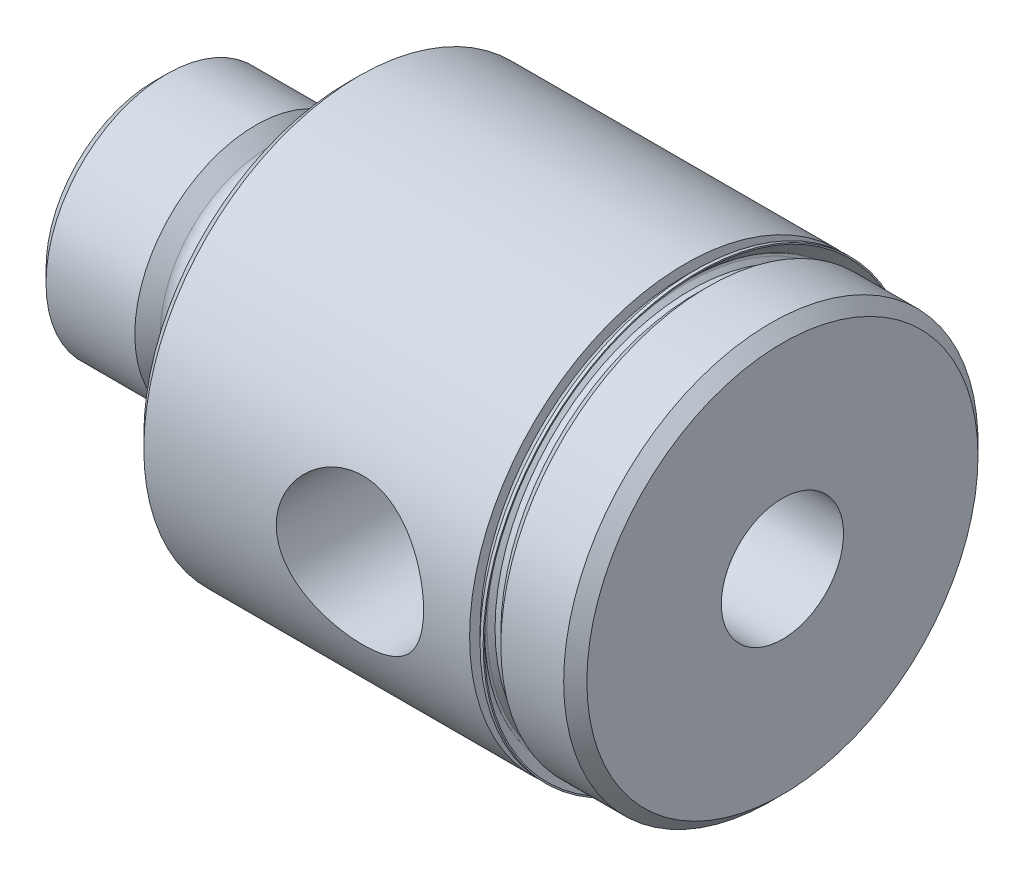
ISO-10303-21;
HEADER;
FILE_DESCRIPTION(('STEP AP214'),'2;1');
FILE_NAME('part.step','',(''),(''),'','','');
FILE_SCHEMA(('AUTOMOTIVE_DESIGN { 1 0 10303 214 1 1 1 1 }'));
ENDSEC;
DATA;
#1=APPLICATION_CONTEXT('core data for automotive mechanical design processes');
#2=APPLICATION_PROTOCOL_DEFINITION('international standard','automotive_design',2000,#1);
#3=PRODUCT_CONTEXT('',#1,'mechanical');
#4=PRODUCT('Part','Part','',(#3));
#5=PRODUCT_RELATED_PRODUCT_CATEGORY('part','',(#4));
#6=PRODUCT_DEFINITION_FORMATION('','',#4);
#7=PRODUCT_DEFINITION_CONTEXT('part definition',#1,'design');
#8=PRODUCT_DEFINITION('design','',#6,#7);
#9=PRODUCT_DEFINITION_SHAPE('','',#8);
#10=(LENGTH_UNIT() NAMED_UNIT(*) SI_UNIT(.MILLI.,.METRE.));
#11=(NAMED_UNIT(*) PLANE_ANGLE_UNIT() SI_UNIT($,.RADIAN.));
#12=(NAMED_UNIT(*) SI_UNIT($,.STERADIAN.) SOLID_ANGLE_UNIT());
#13=UNCERTAINTY_MEASURE_WITH_UNIT(LENGTH_MEASURE(1.E-05),#10,'distance_accuracy_value','');
#14=(GEOMETRIC_REPRESENTATION_CONTEXT(3) GLOBAL_UNCERTAINTY_ASSIGNED_CONTEXT((#13)) GLOBAL_UNIT_ASSIGNED_CONTEXT((#10,
#11,#12)) REPRESENTATION_CONTEXT('',''));
#15=CARTESIAN_POINT('',(0.,0.,0.));
#16=DIRECTION('',(0.,0.,1.));
#17=DIRECTION('',(1.,0.,0.));
#18=AXIS2_PLACEMENT_3D('',#15,#16,#17);
#19=CARTESIAN_POINT('',(41.275,0.,0.));
#20=DIRECTION('',(-1.,0.,0.));
#21=DIRECTION('',(0.,0.,1.));
#22=AXIS2_PLACEMENT_3D('',#19,#20,#21);
#23=CYLINDRICAL_SURFACE('',#22,12.84605);
#24=CARTESIAN_POINT('',(35.2425,0.,0.));
#25=DIRECTION('',(-1.,0.,0.));
#26=DIRECTION('',(0.,0.,1.));
#27=AXIS2_PLACEMENT_3D('',#24,#25,#26);
#28=CIRCLE('',#27,12.84605);
#29=CARTESIAN_POINT('',(35.2425,0.,12.84605));
#30=VERTEX_POINT('',#29);
#31=EDGE_CURVE('E184',#30,#30,#28,.T.);
#32=ORIENTED_EDGE('',*,*,#31,.F.);
#33=EDGE_LOOP('',(#32));
#34=FACE_BOUND('',#33,.T.);
#35=CARTESIAN_POINT('',(35.6235,0.,0.));
#36=DIRECTION('',(1.,0.,0.));
#37=DIRECTION('',(0.,0.,-1.));
#38=AXIS2_PLACEMENT_3D('',#35,#36,#37);
#39=CIRCLE('',#38,12.84605);
#40=CARTESIAN_POINT('',(35.6235,0.,-12.84605));
#41=VERTEX_POINT('',#40);
#42=EDGE_CURVE('E183',#41,#41,#39,.T.);
#43=ORIENTED_EDGE('',*,*,#42,.F.);
#44=EDGE_LOOP('',(#43));
#45=FACE_BOUND('',#44,.T.);
#46=ADVANCED_FACE('F17',(#34,#45),#23,.T.);
#47=CARTESIAN_POINT('',(6.67261207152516,0.,0.));
#48=DIRECTION('',(-1.,0.,0.));
#49=DIRECTION('',(0.,-1.,0.));
#50=AXIS2_PLACEMENT_3D('',#47,#48,#49);
#51=CONICAL_SURFACE('',#50,7.9375,0.784622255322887);
#52=CARTESIAN_POINT('',(6.67261207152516,0.,0.));
#53=DIRECTION('',(-1.,0.,0.));
#54=DIRECTION('',(0.,0.,1.));
#55=AXIS2_PLACEMENT_3D('',#52,#53,#54);
#56=CIRCLE('',#55,7.9375);
#57=CARTESIAN_POINT('',(6.67261207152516,0.,7.9375));
#58=VERTEX_POINT('',#57);
#59=EDGE_CURVE('E619',#58,#58,#56,.T.);
#60=ORIENTED_EDGE('',*,*,#59,.F.);
#61=EDGE_LOOP('',(#60));
#62=FACE_BOUND('',#61,.T.);
#63=CARTESIAN_POINT('',(7.51257001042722,0.,0.));
#64=DIRECTION('',(1.,0.,0.));
#65=DIRECTION('',(0.,0.,-1.));
#66=AXIS2_PLACEMENT_3D('',#63,#64,#65);
#67=CIRCLE('',#66,7.09884451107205);
#68=CARTESIAN_POINT('',(7.51257001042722,0.,-7.09884451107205));
#69=VERTEX_POINT('',#68);
#70=EDGE_CURVE('E180',#69,#69,#67,.F.);
#71=ORIENTED_EDGE('',*,*,#70,.T.);
#72=EDGE_LOOP('',(#71));
#73=FACE_BOUND('',#72,.T.);
#74=ADVANCED_FACE('F313',(#62,#73),#51,.T.);
#75=CARTESIAN_POINT('',(34.9839871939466,0.,0.));
#76=DIRECTION('',(-1.,0.,0.));
#77=DIRECTION('',(0.,0.,1.));
#78=AXIS2_PLACEMENT_3D('',#75,#76,#77);
#79=CONICAL_SURFACE('',#78,13.1045628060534,0.785398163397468);
#80=ORIENTED_EDGE('',*,*,#31,.T.);
#81=EDGE_LOOP('',(#80));
#82=FACE_BOUND('',#81,.T.);
#83=CARTESIAN_POINT('',(34.9839871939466,0.,0.));
#84=DIRECTION('',(1.,0.,0.));
#85=DIRECTION('',(0.,0.,-1.));
#86=AXIS2_PLACEMENT_3D('',#83,#84,#85);
#87=CIRCLE('',#86,13.1045628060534);
#88=CARTESIAN_POINT('',(34.9839871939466,0.,-13.1045628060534));
#89=VERTEX_POINT('',#88);
#90=EDGE_CURVE('E147',#89,#89,#87,.T.);
#91=ORIENTED_EDGE('',*,*,#90,.T.);
#92=EDGE_LOOP('',(#91));
#93=FACE_BOUND('',#92,.T.);
#94=ADVANCED_FACE('F173',(#82,#93),#79,.T.);
#95=CARTESIAN_POINT('',(8.1407,0.,0.));
#96=DIRECTION('',(1.,0.,0.));
#97=DIRECTION('',(0.,0.,-1.));
#98=AXIS2_PLACEMENT_3D('',#95,#96,#97);
#99=TOROIDAL_SURFACE('',#98,7.72795,0.88899999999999);
#100=ORIENTED_EDGE('',*,*,#70,.F.);
#101=EDGE_LOOP('',(#100));
#102=FACE_BOUND('',#101,.T.);
#103=CARTESIAN_POINT('',(8.1407,0.,0.));
#104=DIRECTION('',(-1.,0.,0.));
#105=DIRECTION('',(0.,0.,1.));
#106=AXIS2_PLACEMENT_3D('',#103,#104,#105);
#107=CIRCLE('',#106,6.83895);
#108=CARTESIAN_POINT('',(8.1407,0.,6.83895));
#109=VERTEX_POINT('',#108);
#110=EDGE_CURVE('E142',#109,#109,#107,.F.);
#111=ORIENTED_EDGE('',*,*,#110,.F.);
#112=EDGE_LOOP('',(#111));
#113=FACE_BOUND('',#112,.T.);
#114=ADVANCED_FACE('F168',(#102,#113),#99,.F.);
#115=CARTESIAN_POINT('',(36.3855,0.,0.));
#116=DIRECTION('',(1.,0.,0.));
#117=DIRECTION('',(0.,0.,-1.));
#118=AXIS2_PLACEMENT_3D('',#115,#116,#117);
#119=CONICAL_SURFACE('',#118,13.60805,0.78539816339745);
#120=ORIENTED_EDGE('',*,*,#42,.T.);
#121=EDGE_LOOP('',(#120));
#122=FACE_BOUND('',#121,.T.);
#123=CARTESIAN_POINT('',(36.3855,0.,0.));
#124=DIRECTION('',(-1.,0.,0.));
#125=DIRECTION('',(0.,0.,1.));
#126=AXIS2_PLACEMENT_3D('',#123,#124,#125);
#127=CIRCLE('',#126,13.60805);
#128=CARTESIAN_POINT('',(36.3855,0.,13.60805));
#129=VERTEX_POINT('',#128);
#130=EDGE_CURVE('E137',#129,#129,#127,.F.);
#131=ORIENTED_EDGE('',*,*,#130,.F.);
#132=EDGE_LOOP('',(#131));
#133=FACE_BOUND('',#132,.T.);
#134=ADVANCED_FACE('F164',(#122,#133),#119,.T.);
#135=CARTESIAN_POINT('',(12.7,0.,0.));
#136=DIRECTION('',(-1.,0.,0.));
#137=DIRECTION('',(0.,0.,1.));
#138=AXIS2_PLACEMENT_3D('',#135,#136,#137);
#139=CYLINDRICAL_SURFACE('',#138,7.9375);
#140=CARTESIAN_POINT('',(0.83947,0.,0.));
#141=DIRECTION('',(1.,0.,0.));
#142=DIRECTION('',(0.,0.,-1.));
#143=AXIS2_PLACEMENT_3D('',#140,#141,#142);
#144=CIRCLE('',#143,7.9375);
#145=CARTESIAN_POINT('',(0.83947,0.,-7.9375));
#146=VERTEX_POINT('',#145);
#147=EDGE_CURVE('E132',#146,#146,#144,.F.);
#148=ORIENTED_EDGE('',*,*,#147,.F.);
#149=EDGE_LOOP('',(#148));
#150=FACE_BOUND('',#149,.T.);
#151=ORIENTED_EDGE('',*,*,#59,.T.);
#152=EDGE_LOOP('',(#151));
#153=FACE_BOUND('',#152,.T.);
#154=ADVANCED_FACE('F159',(#150,#153),#139,.T.);
#155=CARTESIAN_POINT('',(35.0737897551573,0.,0.));
#156=DIRECTION('',(1.,0.,0.));
#157=DIRECTION('',(0.,0.,-1.));
#158=AXIS2_PLACEMENT_3D('',#155,#156,#157);
#159=TOROIDAL_SURFACE('',#158,13.1943653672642,0.127000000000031);
#160=CARTESIAN_POINT('',(34.9839871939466,0.,0.));
#161=DIRECTION('',(1.,0.,0.));
#162=DIRECTION('',(0.,0.,-1.));
#163=AXIS2_PLACEMENT_3D('',#160,#161,#162);
#164=CIRCLE('',#163,13.2841679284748);
#165=CARTESIAN_POINT('',(34.9839871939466,0.,-13.2841679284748));
#166=VERTEX_POINT('',#165);
#167=EDGE_CURVE('E118',#166,#166,#164,.T.);
#168=ORIENTED_EDGE('',*,*,#167,.T.);
#169=EDGE_LOOP('',(#168));
#170=FACE_BOUND('',#169,.T.);
#171=ORIENTED_EDGE('',*,*,#90,.F.);
#172=EDGE_LOOP('',(#171));
#173=FACE_BOUND('',#172,.T.);
#174=ADVANCED_FACE('F154',(#170,#173),#159,.F.);
#175=CARTESIAN_POINT('',(12.7,0.,0.));
#176=DIRECTION('',(-1.,0.,0.));
#177=DIRECTION('',(0.,0.,1.));
#178=AXIS2_PLACEMENT_3D('',#175,#176,#177);
#179=CYLINDRICAL_SURFACE('',#178,6.83895);
#180=ORIENTED_EDGE('',*,*,#110,.T.);
#181=EDGE_LOOP('',(#180));
#182=FACE_BOUND('',#181,.T.);
#183=CARTESIAN_POINT('',(9.4234,0.,0.));
#184=DIRECTION('',(1.,0.,0.));
#185=DIRECTION('',(0.,0.,-1.));
#186=AXIS2_PLACEMENT_3D('',#183,#184,#185);
#187=CIRCLE('',#186,6.83894999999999);
#188=CARTESIAN_POINT('',(9.4234,0.,-6.83894999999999));
#189=VERTEX_POINT('',#188);
#190=EDGE_CURVE('E115',#189,#189,#187,.F.);
#191=ORIENTED_EDGE('',*,*,#190,.T.);
#192=EDGE_LOOP('',(#191));
#193=FACE_BOUND('',#192,.T.);
#194=ADVANCED_FACE('F158',(#182,#193),#179,.T.);
#195=CARTESIAN_POINT('',(41.275,0.,0.));
#196=DIRECTION('',(-1.,0.,0.));
#197=DIRECTION('',(0.,0.,1.));
#198=AXIS2_PLACEMENT_3D('',#195,#196,#197);
#199=CYLINDRICAL_SURFACE('',#198,13.60805);
#200=ORIENTED_EDGE('',*,*,#130,.T.);
#201=EDGE_LOOP('',(#200));
#202=FACE_BOUND('',#201,.T.);
#203=CARTESIAN_POINT('',(40.513,0.,0.));
#204=DIRECTION('',(-1.,0.,0.));
#205=DIRECTION('',(0.,0.,1.));
#206=AXIS2_PLACEMENT_3D('',#203,#204,#205);
#207=CIRCLE('',#206,13.60805);
#208=CARTESIAN_POINT('',(40.513,0.,13.60805));
#209=VERTEX_POINT('',#208);
#210=EDGE_CURVE('E77',#209,#209,#207,.F.);
#211=ORIENTED_EDGE('',*,*,#210,.F.);
#212=EDGE_LOOP('',(#211));
#213=FACE_BOUND('',#212,.T.);
#214=ADVANCED_FACE('F272',(#202,#213),#199,.T.);
#215=CARTESIAN_POINT('',(0.83947,0.,0.));
#216=DIRECTION('',(1.,0.,0.));
#217=DIRECTION('',(0.,1.,0.));
#218=AXIS2_PLACEMENT_3D('',#215,#216,#217);
#219=CONICAL_SURFACE('',#218,7.9375,0.785398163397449);
#220=CARTESIAN_POINT('',(0.,0.,0.));
#221=DIRECTION('',(1.,0.,0.));
#222=DIRECTION('',(0.,1.,0.));
#223=AXIS2_PLACEMENT_3D('',#220,#221,#222);
#224=CIRCLE('',#223,7.09803);
#225=CARTESIAN_POINT('',(0.,7.09803,0.));
#226=VERTEX_POINT('',#225);
#227=EDGE_CURVE('E20',#226,#226,#224,.T.);
#228=ORIENTED_EDGE('',*,*,#227,.T.);
#229=EDGE_LOOP('',(#228));
#230=FACE_BOUND('',#229,.T.);
#231=ORIENTED_EDGE('',*,*,#147,.T.);
#232=EDGE_LOOP('',(#231));
#233=FACE_BOUND('',#232,.T.);
#234=ADVANCED_FACE('F274',(#230,#233),#219,.T.);
#235=CARTESIAN_POINT('',(35.7507510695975,0.,0.));
#236=DIRECTION('',(1.,0.,0.));
#237=DIRECTION('',(0.,0.,-1.));
#238=AXIS2_PLACEMENT_3D('',#235,#236,#237);
#239=CONICAL_SURFACE('',#238,14.0509318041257,0.785398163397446);
#240=ORIENTED_EDGE('',*,*,#167,.F.);
#241=EDGE_LOOP('',(#240));
#242=FACE_BOUND('',#241,.T.);
#243=CARTESIAN_POINT('',(35.7507510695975,0.,0.));
#244=DIRECTION('',(1.,0.,0.));
#245=DIRECTION('',(0.,0.,-1.));
#246=AXIS2_PLACEMENT_3D('',#243,#244,#245);
#247=CIRCLE('',#246,14.0509318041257);
#248=CARTESIAN_POINT('',(35.7507510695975,0.,-14.0509318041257));
#249=VERTEX_POINT('',#248);
#250=EDGE_CURVE('E262',#249,#249,#247,.F.);
#251=ORIENTED_EDGE('',*,*,#250,.F.);
#252=EDGE_LOOP('',(#251));
#253=FACE_BOUND('',#252,.T.);
#254=ADVANCED_FACE('F108',(#242,#253),#239,.F.);
#255=CARTESIAN_POINT('',(9.4234,0.,0.));
#256=DIRECTION('',(1.,0.,0.));
#257=DIRECTION('',(0.,0.,-1.));
#258=AXIS2_PLACEMENT_3D('',#255,#256,#257);
#259=TOROIDAL_SURFACE('',#258,7.72795,0.889000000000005);
#260=ORIENTED_EDGE('',*,*,#190,.F.);
#261=EDGE_LOOP('',(#260));
#262=FACE_BOUND('',#261,.T.);
#263=CARTESIAN_POINT('',(10.3124,0.,0.));
#264=DIRECTION('',(-1.,0.,0.));
#265=DIRECTION('',(0.,0.,-1.));
#266=AXIS2_PLACEMENT_3D('',#263,#264,#265);
#267=CIRCLE('',#266,7.72795);
#268=CARTESIAN_POINT('',(10.3124,0.,-7.72795));
#269=VERTEX_POINT('',#268);
#270=EDGE_CURVE('E72',#269,#269,#267,.T.);
#271=ORIENTED_EDGE('',*,*,#270,.T.);
#272=EDGE_LOOP('',(#271));
#273=FACE_BOUND('',#272,.T.);
#274=ADVANCED_FACE('F102',(#262,#273),#259,.F.);
#275=CARTESIAN_POINT('',(40.513,0.,0.));
#276=DIRECTION('',(-1.,0.,0.));
#277=DIRECTION('',(0.,0.,1.));
#278=AXIS2_PLACEMENT_3D('',#275,#276,#277);
#279=CONICAL_SURFACE('',#278,13.60805,0.78539816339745);
#280=ORIENTED_EDGE('',*,*,#210,.T.);
#281=EDGE_LOOP('',(#280));
#282=FACE_BOUND('',#281,.T.);
#283=CARTESIAN_POINT('',(41.275,0.,0.));
#284=DIRECTION('',(-1.,0.,0.));
#285=DIRECTION('',(0.,0.,1.));
#286=AXIS2_PLACEMENT_3D('',#283,#284,#285);
#287=CIRCLE('',#286,12.84605);
#288=CARTESIAN_POINT('',(41.275,0.,12.84605));
#289=VERTEX_POINT('',#288);
#290=EDGE_CURVE('E260',#289,#289,#287,.T.);
#291=ORIENTED_EDGE('',*,*,#290,.T.);
#292=EDGE_LOOP('',(#291));
#293=FACE_BOUND('',#292,.T.);
#294=ADVANCED_FACE('F98',(#282,#293),#279,.T.);
#295=CARTESIAN_POINT('',(0.,0.,0.));
#296=DIRECTION('',(1.,0.,0.));
#297=DIRECTION('',(0.,0.,-1.));
#298=AXIS2_PLACEMENT_3D('',#295,#296,#297);
#299=PLANE('',#298);
#300=CARTESIAN_POINT('',(0.,0.,0.));
#301=DIRECTION('',(-1.,0.,0.));
#302=DIRECTION('',(0.,0.,1.));
#303=AXIS2_PLACEMENT_3D('',#300,#301,#302);
#304=CIRCLE('',#303,4.77519999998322);
#305=CARTESIAN_POINT('',(0.,0.,4.77519999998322));
#306=VERTEX_POINT('',#305);
#307=EDGE_CURVE('E257',#306,#306,#304,.F.);
#308=ORIENTED_EDGE('',*,*,#307,.T.);
#309=EDGE_LOOP('',(#308));
#310=FACE_BOUND('',#309,.T.);
#311=ORIENTED_EDGE('',*,*,#227,.F.);
#312=EDGE_LOOP('',(#311));
#313=FACE_BOUND('',#312,.T.);
#314=ADVANCED_FACE('F94',(#310,#313),#299,.F.);
#315=CARTESIAN_POINT('',(35.7507510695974,14.0509318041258,0.));
#316=DIRECTION('',(1.,0.,0.));
#317=DIRECTION('',(0.,0.,-1.));
#318=AXIS2_PLACEMENT_3D('',#315,#316,#317);
#319=PLANE('',#318);
#320=ORIENTED_EDGE('',*,*,#250,.T.);
#321=EDGE_LOOP('',(#320));
#322=FACE_BOUND('',#321,.T.);
#323=CARTESIAN_POINT('',(35.7507510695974,0.,0.));
#324=DIRECTION('',(-1.,0.,0.));
#325=DIRECTION('',(0.,0.,1.));
#326=AXIS2_PLACEMENT_3D('',#323,#324,#325);
#327=CIRCLE('',#326,14.1351);
#328=CARTESIAN_POINT('',(35.7507510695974,0.,14.1351));
#329=VERTEX_POINT('',#328);
#330=EDGE_CURVE('E246',#329,#329,#327,.T.);
#331=ORIENTED_EDGE('',*,*,#330,.F.);
#332=EDGE_LOOP('',(#331));
#333=FACE_BOUND('',#332,.T.);
#334=ADVANCED_FACE('F90',(#322,#333),#319,.T.);
#335=CARTESIAN_POINT('',(10.3124,7.72795,0.));
#336=DIRECTION('',(1.,0.,0.));
#337=DIRECTION('',(0.,0.,-1.));
#338=AXIS2_PLACEMENT_3D('',#335,#336,#337);
#339=PLANE('',#338);
#340=ORIENTED_EDGE('',*,*,#270,.F.);
#341=EDGE_LOOP('',(#340));
#342=FACE_BOUND('',#341,.T.);
#343=CARTESIAN_POINT('',(10.3124,0.,0.));
#344=DIRECTION('',(-1.,0.,0.));
#345=DIRECTION('',(0.,0.,1.));
#346=AXIS2_PLACEMENT_3D('',#343,#344,#345);
#347=CIRCLE('',#346,7.90575);
#348=CARTESIAN_POINT('',(10.3124,0.,7.90575));
#349=VERTEX_POINT('',#348);
#350=EDGE_CURVE('E241',#349,#349,#347,.F.);
#351=ORIENTED_EDGE('',*,*,#350,.F.);
#352=EDGE_LOOP('',(#351));
#353=FACE_BOUND('',#352,.T.);
#354=ADVANCED_FACE('F79',(#342,#353),#339,.F.);
#355=CARTESIAN_POINT('',(41.275,12.84605,0.));
#356=DIRECTION('',(-1.,0.,0.));
#357=DIRECTION('',(0.,0.,1.));
#358=AXIS2_PLACEMENT_3D('',#355,#356,#357);
#359=PLANE('',#358);
#360=ORIENTED_EDGE('',*,*,#290,.F.);
#361=EDGE_LOOP('',(#360));
#362=FACE_BOUND('',#361,.T.);
#363=CARTESIAN_POINT('',(41.275,0.,0.));
#364=DIRECTION('',(-1.,0.,0.));
#365=DIRECTION('',(0.,0.,1.));
#366=AXIS2_PLACEMENT_3D('',#363,#364,#365);
#367=CIRCLE('',#366,4.0132);
#368=CARTESIAN_POINT('',(41.275,0.,4.0132));
#369=VERTEX_POINT('',#368);
#370=EDGE_CURVE('E237',#369,#369,#367,.T.);
#371=ORIENTED_EDGE('',*,*,#370,.T.);
#372=EDGE_LOOP('',(#371));
#373=FACE_BOUND('',#372,.T.);
#374=ADVANCED_FACE('F89',(#362,#373),#359,.F.);
#375=CARTESIAN_POINT('',(5.6843418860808E-11,0.,0.));
#376=DIRECTION('',(-1.,0.,0.));
#377=DIRECTION('',(0.,0.,1.));
#378=AXIS2_PLACEMENT_3D('',#375,#376,#377);
#379=CONICAL_SURFACE('',#378,4.77519999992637,0.785398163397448);
#380=ORIENTED_EDGE('',*,*,#307,.F.);
#381=EDGE_LOOP('',(#380));
#382=FACE_BOUND('',#381,.T.);
#383=CARTESIAN_POINT('',(0.761999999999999,0.,0.));
#384=DIRECTION('',(-1.,0.,0.));
#385=DIRECTION('',(0.,0.,1.));
#386=AXIS2_PLACEMENT_3D('',#383,#384,#385);
#387=CIRCLE('',#386,4.0132);
#388=CARTESIAN_POINT('',(0.761999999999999,0.,4.0132));
#389=VERTEX_POINT('',#388);
#390=EDGE_CURVE('E49',#389,#389,#387,.F.);
#391=ORIENTED_EDGE('',*,*,#390,.T.);
#392=EDGE_LOOP('',(#391));
#393=FACE_BOUND('',#392,.T.);
#394=ADVANCED_FACE('F428',(#382,#393),#379,.F.);
#395=CARTESIAN_POINT('',(35.6235,0.,0.));
#396=DIRECTION('',(-1.,0.,0.));
#397=DIRECTION('',(0.,0.,1.));
#398=AXIS2_PLACEMENT_3D('',#395,#396,#397);
#399=CYLINDRICAL_SURFACE('',#398,14.1351);
#400=ORIENTED_EDGE('',*,*,#330,.T.);
#401=EDGE_LOOP('',(#400));
#402=FACE_BOUND('',#401,.T.);
#403=CARTESIAN_POINT('',(35.5475510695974,0.,0.));
#404=DIRECTION('',(1.,0.,0.));
#405=DIRECTION('',(0.,0.,-1.));
#406=AXIS2_PLACEMENT_3D('',#403,#404,#405);
#407=CIRCLE('',#406,14.1351);
#408=CARTESIAN_POINT('',(35.5475510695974,0.,-14.1351));
#409=VERTEX_POINT('',#408);
#410=EDGE_CURVE('E231',#409,#409,#407,.F.);
#411=ORIENTED_EDGE('',*,*,#410,.F.);
#412=EDGE_LOOP('',(#411));
#413=FACE_BOUND('',#412,.T.);
#414=ADVANCED_FACE('F438',(#402,#413),#399,.T.);
#415=CARTESIAN_POINT('',(12.7,0.,0.));
#416=DIRECTION('',(-1.,0.,0.));
#417=DIRECTION('',(0.,0.,1.));
#418=AXIS2_PLACEMENT_3D('',#415,#416,#417);
#419=CYLINDRICAL_SURFACE('',#418,7.90575);
#420=ORIENTED_EDGE('',*,*,#350,.T.);
#421=EDGE_LOOP('',(#420));
#422=FACE_BOUND('',#421,.T.);
#423=CARTESIAN_POINT('',(12.7,0.,0.));
#424=DIRECTION('',(-1.,0.,0.));
#425=DIRECTION('',(0.,0.,1.));
#426=AXIS2_PLACEMENT_3D('',#423,#424,#425);
#427=CIRCLE('',#426,7.90575);
#428=CARTESIAN_POINT('',(12.7,0.,7.90575));
#429=VERTEX_POINT('',#428);
#430=EDGE_CURVE('E57',#429,#429,#427,.T.);
#431=ORIENTED_EDGE('',*,*,#430,.T.);
#432=EDGE_LOOP('',(#431));
#433=FACE_BOUND('',#432,.T.);
#434=ADVANCED_FACE('F448',(#422,#433),#419,.T.);
#435=CARTESIAN_POINT('',(27.0002,0.,14.1351));
#436=DIRECTION('',(0.,0.,-1.));
#437=DIRECTION('',(-1.,0.,0.));
#438=AXIS2_PLACEMENT_3D('',#435,#436,#437);
#439=CYLINDRICAL_SURFACE('',#438,3.175);
#440=CARTESIAN_POINT('',(24.8808047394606,2.36406191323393,3.24299021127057));
#441=CARTESIAN_POINT('',(24.9460284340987,2.42250816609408,3.20039961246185));
#442=CARTESIAN_POINT('',(25.0134972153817,2.47815376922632,3.157400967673));
#443=CARTESIAN_POINT('',(25.1529705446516,2.58380866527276,3.07153419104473));
#444=CARTESIAN_POINT('',(25.2249811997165,2.63381010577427,3.02866631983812));
#445=CARTESIAN_POINT('',(25.3745170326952,2.72868638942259,2.9434965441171));
#446=CARTESIAN_POINT('',(25.452108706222,2.77347312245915,2.90121276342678));
#447=CARTESIAN_POINT('',(25.6118173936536,2.85676852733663,2.81923091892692));
#448=CARTESIAN_POINT('',(25.6939314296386,2.8952812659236,2.77953119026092));
#449=CARTESIAN_POINT('',(25.8938715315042,2.97864506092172,2.69042612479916));
#450=CARTESIAN_POINT('',(26.0137391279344,3.02063063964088,2.64280984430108));
#451=CARTESIAN_POINT('',(26.2613219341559,3.09048273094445,2.56078410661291));
#452=CARTESIAN_POINT('',(26.3889918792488,3.11842335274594,2.52630556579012));
#453=CARTESIAN_POINT('',(26.6289255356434,3.15514900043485,2.48023095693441));
#454=CARTESIAN_POINT('',(26.740256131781,3.16633376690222,2.4657982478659));
#455=CARTESIAN_POINT('',(26.964413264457,3.1767761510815,2.452336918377));
#456=CARTESIAN_POINT('',(27.0772390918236,3.17603923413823,2.45330123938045));
#457=CARTESIAN_POINT('',(27.300651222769,3.16273044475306,2.47042661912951));
#458=CARTESIAN_POINT('',(27.4112426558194,3.15018984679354,2.48654751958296));
#459=CARTESIAN_POINT('',(27.6280754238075,3.11424543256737,2.53141496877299));
#460=CARTESIAN_POINT('',(27.7343081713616,3.0908211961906,2.56018524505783));
#461=CARTESIAN_POINT('',(27.997915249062,3.01874375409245,2.6452782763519));
#462=CARTESIAN_POINT('',(28.1513097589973,2.96330022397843,2.70805360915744));
#463=CARTESIAN_POINT('',(28.4439140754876,2.83233517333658,2.84475715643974));
#464=CARTESIAN_POINT('',(28.5830910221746,2.75676853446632,2.91871026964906));
#465=CARTESIAN_POINT('',(28.7869658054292,2.62589789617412,3.03550235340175));
#466=CARTESIAN_POINT('',(28.8566447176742,2.57710562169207,3.07712312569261));
#467=CARTESIAN_POINT('',(28.9914276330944,2.47442067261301,3.16027850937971));
#468=CARTESIAN_POINT('',(29.0565550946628,2.42055812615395,3.20181229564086));
#469=CARTESIAN_POINT('',(29.1195952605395,2.36406191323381,3.24299021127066));
#470=B_SPLINE_CURVE_WITH_KNOTS('',3,(#440,#441,#442,#443,#444,#445,#446,#447,#448,#449,#450,
#451,#452,#453,#454,#455,#456,#457,#458,#459,#460,#461,#462,#463,#464,#465,#466,#467,#468,#469),
.UNSPECIFIED.,.F.,.F.,(4,2,2,2,2,2,2,2,2,2,2,2,2,2,4),(0.,0.292093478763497,0.584588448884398,
0.881469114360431,1.17815657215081,1.58378780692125,1.98725562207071,2.32416137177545,
2.66091267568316,2.996774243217,3.33326852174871,3.8546926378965,4.37729583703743,
4.66117933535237,4.94347128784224),.UNSPECIFIED.);
#471=CARTESIAN_POINT('',(24.8808047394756,2.36406191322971,3.24299021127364));
#472=VERTEX_POINT('',#471);
#473=CARTESIAN_POINT('',(29.1195952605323,2.36406191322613,3.24299021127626));
#474=VERTEX_POINT('',#473);
#475=EDGE_CURVE('E45',#472,#474,#470,.T.);
#476=ORIENTED_EDGE('',*,*,#475,.T.);
#477=CARTESIAN_POINT('',(27.0002,0.,3.24299021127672));
#478=DIRECTION('',(0.,0.,1.));
#479=DIRECTION('',(1.,0.,0.));
#480=AXIS2_PLACEMENT_3D('',#477,#478,#479);
#481=CIRCLE('',#480,3.17499999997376);
#482=EDGE_CURVE('E48',#474,#472,#481,.T.);
#483=ORIENTED_EDGE('',*,*,#482,.T.);
#484=EDGE_LOOP('',(#476,#483));
#485=FACE_BOUND('',#484,.T.);
#486=ADVANCED_FACE('F46',(#485),#439,.F.);
#487=CARTESIAN_POINT('',(41.275,0.,0.));
#488=DIRECTION('',(-1.,0.,0.));
#489=DIRECTION('',(0.,0.,1.));
#490=AXIS2_PLACEMENT_3D('',#487,#488,#489);
#491=CYLINDRICAL_SURFACE('',#490,4.0132);
#492=CARTESIAN_POINT('',(29.119595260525,-2.36406191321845,3.24299021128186));
#493=CARTESIAN_POINT('',(29.2244553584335,-2.31652096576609,3.27762366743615));
#494=CARTESIAN_POINT('',(29.3271739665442,-2.26507332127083,3.31354919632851));
#495=CARTESIAN_POINT('',(29.5278219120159,-2.15376180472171,3.38697267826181));
#496=CARTESIAN_POINT('',(29.625734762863,-2.09387136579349,3.42447532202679));
#497=CARTESIAN_POINT('',(29.8169878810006,-1.96441830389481,3.50036279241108));
#498=CARTESIAN_POINT('',(29.91023869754,-1.89472530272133,3.53875245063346));
#499=CARTESIAN_POINT('',(30.0891400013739,-1.74590928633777,3.61448994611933));
#500=CARTESIAN_POINT('',(30.1748017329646,-1.66680064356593,3.65183926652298));
#501=CARTESIAN_POINT('',(30.3450197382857,-1.49009668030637,3.7276716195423));
#502=CARTESIAN_POINT('',(30.4286102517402,-1.39144398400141,3.76589501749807));
#503=CARTESIAN_POINT('',(30.580980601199,-1.18199782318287,3.83676864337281));
#504=CARTESIAN_POINT('',(30.6498256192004,-1.07126119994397,3.86944326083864));
#505=CARTESIAN_POINT('',(30.7588271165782,-0.857643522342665,3.92175896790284));
#506=CARTESIAN_POINT('',(30.8018581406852,-0.756557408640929,3.94266672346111));
#507=CARTESIAN_POINT('',(30.8722140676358,-0.54776055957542,3.97704612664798));
#508=CARTESIAN_POINT('',(30.8995431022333,-0.440051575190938,3.99051973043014));
#509=CARTESIAN_POINT('',(30.9363135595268,-0.220151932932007,4.00868200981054));
#510=CARTESIAN_POINT('',(30.9456463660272,-0.107938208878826,4.01331734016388));
#511=CARTESIAN_POINT('',(30.9451641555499,0.116427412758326,4.01307817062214));
#512=CARTESIAN_POINT('',(30.9353523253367,0.228579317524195,4.00820525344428));
#513=CARTESIAN_POINT('',(30.899449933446,0.437990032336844,3.99047554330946));
#514=CARTESIAN_POINT('',(30.875066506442,0.535624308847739,3.97845660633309));
#515=CARTESIAN_POINT('',(30.8132726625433,0.725611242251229,3.9482313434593));
#516=CARTESIAN_POINT('',(30.7758584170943,0.817962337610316,3.9300231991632));
#517=CARTESIAN_POINT('',(30.6715422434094,1.03447863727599,3.87978492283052));
#518=CARTESIAN_POINT('',(30.5988775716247,1.15526479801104,3.8451773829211));
#519=CARTESIAN_POINT('',(30.4364259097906,1.38253333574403,3.76945839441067));
#520=CARTESIAN_POINT('',(30.3465899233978,1.4889732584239,3.72832839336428));
#521=CARTESIAN_POINT('',(30.1096937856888,1.73361200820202,3.62289919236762));
#522=CARTESIAN_POINT('',(29.9553341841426,1.86385988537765,3.55665355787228));
#523=CARTESIAN_POINT('',(29.6276983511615,2.09702642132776,3.42435472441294));
#524=CARTESIAN_POINT('',(29.4544315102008,2.19995856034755,3.35830144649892));
#525=CARTESIAN_POINT('',(29.2230973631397,2.31595069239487,3.27766486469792));
#526=CARTESIAN_POINT('',(29.1716045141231,2.34049028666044,3.26016664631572));
#527=CARTESIAN_POINT('',(29.119595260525,2.36406191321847,3.24299021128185));
#528=B_SPLINE_CURVE_WITH_KNOTS('',3,(#492,#493,#494,#495,#496,#497,#498,#499,#500,#501,#502,
#503,#504,#505,#506,#507,#508,#509,#510,#511,#512,#513,#514,#515,#516,#517,#518,#519,#520,#521,
#522,#523,#524,#525,#526,#527),.UNSPECIFIED.,.F.,.F.,(4,2,2,2,2,2,2,2,2,2,2,2,2,2,2,2,2,4),(0.,
0.36067484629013,0.722511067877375,1.08971842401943,1.45637227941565,1.85966330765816,
2.26113302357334,2.59530312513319,2.92938525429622,3.26547750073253,3.60151380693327,
3.90429405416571,4.20716333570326,4.64016068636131,5.07441250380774,5.70866512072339,
6.34260415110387,6.52154341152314),.UNSPECIFIED.);
#529=CARTESIAN_POINT('',(29.1195952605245,-2.36406191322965,3.24299021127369));
#530=VERTEX_POINT('',#529);
#531=EDGE_CURVE('E52',#530,#474,#528,.T.);
#532=ORIENTED_EDGE('',*,*,#531,.T.);
#533=ORIENTED_EDGE('',*,*,#475,.F.);
#534=CARTESIAN_POINT('',(24.8808047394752,2.36406191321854,3.24299021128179));
#535=CARTESIAN_POINT('',(24.7759446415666,2.31652096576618,3.27762366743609));
#536=CARTESIAN_POINT('',(24.673226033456,2.26507332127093,3.31354919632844));
#537=CARTESIAN_POINT('',(24.4725780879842,2.15376180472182,3.38697267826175));
#538=CARTESIAN_POINT('',(24.3746652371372,2.0938713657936,3.42447532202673));
#539=CARTESIAN_POINT('',(24.1834121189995,1.96441830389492,3.50036279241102));
#540=CARTESIAN_POINT('',(24.0901613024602,1.89472530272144,3.5387524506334));
#541=CARTESIAN_POINT('',(23.9112599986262,1.74590928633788,3.61448994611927));
#542=CARTESIAN_POINT('',(23.8255982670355,1.66680064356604,3.65183926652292));
#543=CARTESIAN_POINT('',(23.6553802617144,1.49009668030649,3.72767161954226));
#544=CARTESIAN_POINT('',(23.5717897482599,1.39144398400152,3.76589501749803));
#545=CARTESIAN_POINT('',(23.4194193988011,1.18199782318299,3.83676864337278));
#546=CARTESIAN_POINT('',(23.3505743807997,1.07126119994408,3.86944326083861));
#547=CARTESIAN_POINT('',(23.2415728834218,0.857643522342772,3.92175896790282));
#548=CARTESIAN_POINT('',(23.1985418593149,0.756557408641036,3.94266672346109));
#549=CARTESIAN_POINT('',(23.1281859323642,0.547760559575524,3.97704612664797));
#550=CARTESIAN_POINT('',(23.1008568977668,0.440051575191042,3.99051973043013));
#551=CARTESIAN_POINT('',(23.0640864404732,0.220151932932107,4.00868200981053));
#552=CARTESIAN_POINT('',(23.0547536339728,0.107938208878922,4.01331734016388));
#553=CARTESIAN_POINT('',(23.0552358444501,-0.116427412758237,4.01307817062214));
#554=CARTESIAN_POINT('',(23.0650476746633,-0.22857931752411,4.00820525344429));
#555=CARTESIAN_POINT('',(23.100950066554,-0.437990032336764,3.99047554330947));
#556=CARTESIAN_POINT('',(23.125333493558,-0.53562430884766,3.9784566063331));
#557=CARTESIAN_POINT('',(23.1871273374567,-0.725611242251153,3.94823134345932));
#558=CARTESIAN_POINT('',(23.2245415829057,-0.817962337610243,3.93002319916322));
#559=CARTESIAN_POINT('',(23.3288577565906,-1.03447863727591,3.87978492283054));
#560=CARTESIAN_POINT('',(23.4015224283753,-1.15526479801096,3.84517738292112));
#561=CARTESIAN_POINT('',(23.5639740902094,-1.38253333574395,3.7694583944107));
#562=CARTESIAN_POINT('',(23.6538100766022,-1.48897325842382,3.72832839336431));
#563=CARTESIAN_POINT('',(23.8907062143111,-1.73361200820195,3.62289919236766));
#564=CARTESIAN_POINT('',(24.0450658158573,-1.86385988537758,3.55665355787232));
#565=CARTESIAN_POINT('',(24.3727016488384,-2.09702642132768,3.42435472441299));
#566=CARTESIAN_POINT('',(24.5459684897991,-2.19995856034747,3.35830144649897));
#567=CARTESIAN_POINT('',(24.7773026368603,-2.31595069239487,3.27766486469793));
#568=CARTESIAN_POINT('',(24.828795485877,-2.34049028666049,3.26016664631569));
#569=CARTESIAN_POINT('',(24.8808047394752,-2.36406191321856,3.24299021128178));
#570=B_SPLINE_CURVE_WITH_KNOTS('',3,(#534,#535,#536,#537,#538,#539,#540,#541,#542,#543,#544,
#545,#546,#547,#548,#549,#550,#551,#552,#553,#554,#555,#556,#557,#558,#559,#560,#561,#562,#563,
#564,#565,#566,#567,#568,#569),.UNSPECIFIED.,.F.,.F.,(4,2,2,2,2,2,2,2,2,2,2,2,2,2,2,2,2,4),(0.,
0.360674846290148,0.72251106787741,1.08971842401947,1.45637227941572,1.85966330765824,
2.26113302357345,2.59530312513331,2.92938525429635,3.26547750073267,3.60151380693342,
3.90429405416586,4.20716333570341,4.64016068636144,5.07441250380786,5.70866512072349,
6.34260415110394,6.52154341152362),.UNSPECIFIED.);
#571=CARTESIAN_POINT('',(24.8808047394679,-2.36406191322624,3.24299021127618));
#572=VERTEX_POINT('',#571);
#573=EDGE_CURVE('E35',#472,#572,#570,.T.);
#574=ORIENTED_EDGE('',*,*,#573,.T.);
#575=CARTESIAN_POINT('',(24.8808047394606,-2.36406191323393,3.24299021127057));
#576=CARTESIAN_POINT('',(24.9460284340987,-2.42250816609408,3.20039961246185));
#577=CARTESIAN_POINT('',(25.0134972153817,-2.47815376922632,3.157400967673));
#578=CARTESIAN_POINT('',(25.1529705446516,-2.58380866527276,3.07153419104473));
#579=CARTESIAN_POINT('',(25.2249811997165,-2.63381010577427,3.02866631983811));
#580=CARTESIAN_POINT('',(25.3745170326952,-2.72868638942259,2.9434965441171));
#581=CARTESIAN_POINT('',(25.452108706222,-2.77347312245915,2.90121276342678));
#582=CARTESIAN_POINT('',(25.6118173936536,-2.85676852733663,2.81923091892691));
#583=CARTESIAN_POINT('',(25.6939314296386,-2.8952812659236,2.77953119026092));
#584=CARTESIAN_POINT('',(25.8938715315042,-2.97864506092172,2.69042612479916));
#585=CARTESIAN_POINT('',(26.0137391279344,-3.02063063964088,2.64280984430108));
#586=CARTESIAN_POINT('',(26.2613219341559,-3.09048273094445,2.56078410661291));
#587=CARTESIAN_POINT('',(26.3889918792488,-3.11842335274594,2.52630556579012));
#588=CARTESIAN_POINT('',(26.6289255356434,-3.15514900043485,2.48023095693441));
#589=CARTESIAN_POINT('',(26.740256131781,-3.16633376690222,2.4657982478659));
#590=CARTESIAN_POINT('',(26.964413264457,-3.1767761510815,2.45233691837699));
#591=CARTESIAN_POINT('',(27.0772390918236,-3.17603923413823,2.45330123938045));
#592=CARTESIAN_POINT('',(27.300651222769,-3.16273044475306,2.47042661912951));
#593=CARTESIAN_POINT('',(27.4112426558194,-3.15018984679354,2.48654751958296));
#594=CARTESIAN_POINT('',(27.6280754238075,-3.11424543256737,2.53141496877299));
#595=CARTESIAN_POINT('',(27.7343081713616,-3.0908211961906,2.56018524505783));
#596=CARTESIAN_POINT('',(27.997915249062,-3.01874375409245,2.6452782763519));
#597=CARTESIAN_POINT('',(28.1513097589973,-2.96330022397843,2.70805360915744));
#598=CARTESIAN_POINT('',(28.4439140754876,-2.83233517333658,2.84475715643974));
#599=CARTESIAN_POINT('',(28.5830910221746,-2.75676853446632,2.91871026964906));
#600=CARTESIAN_POINT('',(28.7869658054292,-2.62589789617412,3.03550235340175));
#601=CARTESIAN_POINT('',(28.8566447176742,-2.57710562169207,3.07712312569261));
#602=CARTESIAN_POINT('',(28.9914276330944,-2.47442067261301,3.16027850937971));
#603=CARTESIAN_POINT('',(29.0565550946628,-2.42055812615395,3.20181229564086));
#604=CARTESIAN_POINT('',(29.1195952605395,-2.36406191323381,3.24299021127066));
#605=B_SPLINE_CURVE_WITH_KNOTS('',3,(#575,#576,#577,#578,#579,#580,#581,#582,#583,#584,#585,
#586,#587,#588,#589,#590,#591,#592,#593,#594,#595,#596,#597,#598,#599,#600,#601,#602,#603,#604),
.UNSPECIFIED.,.F.,.F.,(4,2,2,2,2,2,2,2,2,2,2,2,2,2,4),(0.,0.2920934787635,0.584588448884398,
0.88146911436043,1.17815657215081,1.58378780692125,1.98725562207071,2.32416137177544,
2.66091267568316,2.996774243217,3.33326852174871,3.8546926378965,4.37729583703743,
4.66117933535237,4.94347128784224),.UNSPECIFIED.);
#606=EDGE_CURVE('E41',#572,#530,#605,.T.);
#607=ORIENTED_EDGE('',*,*,#606,.T.);
#608=EDGE_LOOP('',(#532,#533,#574,#607));
#609=FACE_BOUND('',#608,.T.);
#610=ORIENTED_EDGE('',*,*,#390,.F.);
#611=EDGE_LOOP('',(#610));
#612=FACE_BOUND('',#611,.T.);
#613=ORIENTED_EDGE('',*,*,#370,.F.);
#614=EDGE_LOOP('',(#613));
#615=FACE_BOUND('',#614,.T.);
#616=ADVANCED_FACE('F53',(#609,#612,#615),#491,.F.);
#617=CARTESIAN_POINT('',(27.0002,0.,14.1351));
#618=DIRECTION('',(0.,0.,-1.));
#619=DIRECTION('',(-1.,0.,0.));
#620=AXIS2_PLACEMENT_3D('',#617,#618,#619);
#621=CYLINDRICAL_SURFACE('',#620,3.175);
#622=ORIENTED_EDGE('',*,*,#606,.F.);
#623=CARTESIAN_POINT('',(27.0002,0.,3.24299021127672));
#624=DIRECTION('',(0.,0.,1.));
#625=DIRECTION('',(1.,0.,0.));
#626=AXIS2_PLACEMENT_3D('',#623,#624,#625);
#627=CIRCLE('',#626,3.17499999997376);
#628=EDGE_CURVE('E62',#572,#530,#627,.T.);
#629=ORIENTED_EDGE('',*,*,#628,.T.);
#630=EDGE_LOOP('',(#622,#629));
#631=FACE_BOUND('',#630,.T.);
#632=ADVANCED_FACE('F477',(#631),#621,.F.);
#633=CARTESIAN_POINT('',(35.5475510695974,0.,0.));
#634=DIRECTION('',(1.,0.,0.));
#635=DIRECTION('',(0.,0.,-1.));
#636=AXIS2_PLACEMENT_3D('',#633,#634,#635);
#637=CONICAL_SURFACE('',#636,14.1351,0.785398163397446);
#638=ORIENTED_EDGE('',*,*,#410,.T.);
#639=EDGE_LOOP('',(#638));
#640=FACE_BOUND('',#639,.T.);
#641=CARTESIAN_POINT('',(34.8615,0.,0.));
#642=DIRECTION('',(1.,0.,0.));
#643=DIRECTION('',(0.,0.,-1.));
#644=AXIS2_PLACEMENT_3D('',#641,#642,#643);
#645=CIRCLE('',#644,13.4490489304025);
#646=CARTESIAN_POINT('',(34.8615,0.,-13.4490489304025));
#647=VERTEX_POINT('',#646);
#648=EDGE_CURVE('E225',#647,#647,#645,.T.);
#649=ORIENTED_EDGE('',*,*,#648,.T.);
#650=EDGE_LOOP('',(#649));
#651=FACE_BOUND('',#650,.T.);
#652=ADVANCED_FACE('F486',(#640,#651),#637,.T.);
#653=CARTESIAN_POINT('',(12.7,0.,0.));
#654=DIRECTION('',(1.,0.,0.));
#655=DIRECTION('',(0.,0.,-1.));
#656=AXIS2_PLACEMENT_3D('',#653,#654,#655);
#657=PLANE('',#656);
#658=ORIENTED_EDGE('',*,*,#430,.F.);
#659=EDGE_LOOP('',(#658));
#660=FACE_BOUND('',#659,.T.);
#661=CARTESIAN_POINT('',(12.7,0.,0.));
#662=DIRECTION('',(1.,0.,0.));
#663=DIRECTION('',(0.,1.,0.));
#664=AXIS2_PLACEMENT_3D('',#661,#662,#663);
#665=CIRCLE('',#664,13.3731);
#666=CARTESIAN_POINT('',(12.7,13.3731,0.));
#667=VERTEX_POINT('',#666);
#668=EDGE_CURVE('E221',#667,#667,#665,.T.);
#669=ORIENTED_EDGE('',*,*,#668,.F.);
#670=EDGE_LOOP('',(#669));
#671=FACE_BOUND('',#670,.T.);
#672=ADVANCED_FACE('F497',(#660,#671),#657,.F.);
#673=CARTESIAN_POINT('',(27.0002,0.,4.61009999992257));
#674=DIRECTION('',(0.,0.,1.));
#675=DIRECTION('',(1.,0.,0.));
#676=AXIS2_PLACEMENT_3D('',#673,#674,#675);
#677=CONICAL_SURFACE('',#676,4.54210978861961,0.785398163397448);
#678=ORIENTED_EDGE('',*,*,#573,.F.);
#679=ORIENTED_EDGE('',*,*,#482,.F.);
#680=ORIENTED_EDGE('',*,*,#531,.F.);
#681=ORIENTED_EDGE('',*,*,#628,.F.);
#682=EDGE_LOOP('',(#678,#679,#680,#681));
#683=FACE_BOUND('',#682,.T.);
#684=CARTESIAN_POINT('',(27.0002,0.,4.61009999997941));
#685=DIRECTION('',(0.,0.,1.));
#686=DIRECTION('',(1.,0.,0.));
#687=AXIS2_PLACEMENT_3D('',#684,#685,#686);
#688=CIRCLE('',#687,4.54210978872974);
#689=CARTESIAN_POINT('',(31.5423097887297,0.,4.61009999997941));
#690=VERTEX_POINT('',#689);
#691=EDGE_CURVE('E218',#690,#690,#688,.T.);
#692=ORIENTED_EDGE('',*,*,#691,.T.);
#693=EDGE_LOOP('',(#692));
#694=FACE_BOUND('',#693,.T.);
#695=ADVANCED_FACE('F59',(#683,#694),#677,.F.);
#696=CARTESIAN_POINT('',(34.8615,14.1351,0.));
#697=DIRECTION('',(-1.,0.,0.));
#698=DIRECTION('',(0.,0.,1.));
#699=AXIS2_PLACEMENT_3D('',#696,#697,#698);
#700=PLANE('',#699);
#701=CARTESIAN_POINT('',(34.8615,0.,0.));
#702=DIRECTION('',(-1.,0.,0.));
#703=DIRECTION('',(0.,0.,1.));
#704=AXIS2_PLACEMENT_3D('',#701,#702,#703);
#705=CIRCLE('',#704,14.1351);
#706=CARTESIAN_POINT('',(34.8615,0.,14.1351));
#707=VERTEX_POINT('',#706);
#708=EDGE_CURVE('E195',#707,#707,#705,.T.);
#709=ORIENTED_EDGE('',*,*,#708,.F.);
#710=EDGE_LOOP('',(#709));
#711=FACE_BOUND('',#710,.T.);
#712=ORIENTED_EDGE('',*,*,#648,.F.);
#713=EDGE_LOOP('',(#712));
#714=FACE_BOUND('',#713,.T.);
#715=ADVANCED_FACE('F518',(#711,#714),#700,.F.);
#716=CARTESIAN_POINT('',(13.462,0.,0.));
#717=DIRECTION('',(1.,0.,0.));
#718=DIRECTION('',(0.,1.,0.));
#719=AXIS2_PLACEMENT_3D('',#716,#717,#718);
#720=CONICAL_SURFACE('',#719,14.1351,0.785398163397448);
#721=ORIENTED_EDGE('',*,*,#668,.T.);
#722=EDGE_LOOP('',(#721));
#723=FACE_BOUND('',#722,.T.);
#724=CARTESIAN_POINT('',(13.462,0.,0.));
#725=DIRECTION('',(-1.,0.,0.));
#726=DIRECTION('',(0.,0.,1.));
#727=AXIS2_PLACEMENT_3D('',#724,#725,#726);
#728=CIRCLE('',#727,14.1351);
#729=CARTESIAN_POINT('',(13.462,0.,14.1351));
#730=VERTEX_POINT('',#729);
#731=EDGE_CURVE('E26',#730,#730,#728,.F.);
#732=ORIENTED_EDGE('',*,*,#731,.F.);
#733=EDGE_LOOP('',(#732));
#734=FACE_BOUND('',#733,.T.);
#735=ADVANCED_FACE('F208',(#723,#734),#720,.T.);
#736=CARTESIAN_POINT('',(27.0002,0.,14.1932791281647));
#737=DIRECTION('',(0.,0.,1.));
#738=DIRECTION('',(1.,0.,0.));
#739=AXIS2_PLACEMENT_3D('',#736,#737,#738);
#740=CONICAL_SURFACE('',#739,4.84129225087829,0.0312094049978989);
#741=ORIENTED_EDGE('',*,*,#691,.F.);
#742=EDGE_LOOP('',(#741));
#743=FACE_BOUND('',#742,.T.);
#744=CARTESIAN_POINT('',(23.5234239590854,-3.34830561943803,13.7328038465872));
#745=CARTESIAN_POINT('',(23.3368710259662,-3.15669702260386,13.7795195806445));
#746=CARTESIAN_POINT('',(23.16621643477,-2.94950218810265,13.8257732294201));
#747=CARTESIAN_POINT('',(22.8612527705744,-2.5088201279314,13.9124842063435));
#748=CARTESIAN_POINT('',(22.7269350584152,-2.2753391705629,13.9529429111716));
#749=CARTESIAN_POINT('',(22.4985251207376,-1.78733031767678,14.0238139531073));
#750=CARTESIAN_POINT('',(22.4045230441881,-1.53275675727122,14.0542037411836));
#751=CARTESIAN_POINT('',(22.2606674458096,-1.0102186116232,14.1013904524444));
#752=CARTESIAN_POINT('',(22.2108015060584,-0.742257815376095,14.1181911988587));
#753=CARTESIAN_POINT('',(22.1582906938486,-0.211890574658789,14.1359044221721));
#754=CARTESIAN_POINT('',(22.153867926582,0.0503206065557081,14.137415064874));
#755=CARTESIAN_POINT('',(22.1877964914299,0.571612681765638,14.1259429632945));
#756=CARTESIAN_POINT('',(22.2261437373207,0.830693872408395,14.1129616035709));
#757=CARTESIAN_POINT('',(22.342860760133,1.33282594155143,14.0743301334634));
#758=CARTESIAN_POINT('',(22.4203693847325,1.57609966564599,14.0489529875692));
#759=CARTESIAN_POINT('',(22.6123172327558,2.04625406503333,13.9882145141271));
#760=CARTESIAN_POINT('',(22.7267626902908,2.2731319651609,13.9528515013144));
#761=CARTESIAN_POINT('',(22.9941322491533,2.71328133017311,13.8741131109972));
#762=CARTESIAN_POINT('',(23.1483258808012,2.92573623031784,13.8304892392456));
#763=CARTESIAN_POINT('',(23.4887589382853,3.32259511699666,13.7405565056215));
#764=CARTESIAN_POINT('',(23.6750089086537,3.50698983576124,13.6942467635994));
#765=CARTESIAN_POINT('',(24.0846219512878,3.85147962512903,13.6014893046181));
#766=CARTESIAN_POINT('',(24.3093228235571,4.01001482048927,13.5551384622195));
#767=CARTESIAN_POINT('',(24.7833869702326,4.28731932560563,13.4700063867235));
#768=CARTESIAN_POINT('',(25.0327485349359,4.40609138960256,13.431224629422));
#769=CARTESIAN_POINT('',(25.5473059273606,4.59921132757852,13.3663261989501));
#770=CARTESIAN_POINT('',(25.8123505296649,4.67392530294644,13.3401055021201));
#771=CARTESIAN_POINT('',(26.3522595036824,4.7776056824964,13.3033321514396));
#772=CARTESIAN_POINT('',(26.6271196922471,4.80659134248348,13.2927729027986));
#773=CARTESIAN_POINT('',(27.1639041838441,4.81737697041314,13.2888644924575));
#774=CARTESIAN_POINT('',(27.4257786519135,4.80149225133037,13.2946708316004));
#775=CARTESIAN_POINT('',(27.9428471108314,4.72808279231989,13.3209525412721));
#776=CARTESIAN_POINT('',(28.1980410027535,4.67055743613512,13.3414281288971));
#777=CARTESIAN_POINT('',(28.6928136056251,4.51651824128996,13.3943503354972));
#778=CARTESIAN_POINT('',(28.9324972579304,4.42030746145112,13.426703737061));
#779=CARTESIAN_POINT('',(29.3926187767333,4.19181379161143,13.4997809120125));
#780=CARTESIAN_POINT('',(29.6130517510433,4.05952176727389,13.5405068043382));
#781=CARTESIAN_POINT('',(30.0397335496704,3.7550972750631,13.6281513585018));
#782=CARTESIAN_POINT('',(30.2447956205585,3.58135877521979,13.6752733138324));
#783=CARTESIAN_POINT('',(30.623411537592,3.2022129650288,13.7689858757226));
#784=CARTESIAN_POINT('',(30.7969585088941,2.99679876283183,13.8155763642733));
#785=CARTESIAN_POINT('',(31.112098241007,2.55325719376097,13.9044726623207));
#786=CARTESIAN_POINT('',(31.2527123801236,2.31440191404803,13.9466305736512));
#787=CARTESIAN_POINT('',(31.4912154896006,1.81472595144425,14.0203948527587));
#788=CARTESIAN_POINT('',(31.5891171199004,1.55391180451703,14.0520043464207));
#789=CARTESIAN_POINT('',(31.7357145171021,1.02791041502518,14.1000560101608));
#790=CARTESIAN_POINT('',(31.7860953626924,0.763241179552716,14.1170156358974));
#791=CARTESIAN_POINT('',(31.8417466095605,0.228701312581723,14.1357764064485));
#792=CARTESIAN_POINT('',(31.8470308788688,-0.0411676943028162,14.13758221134));
#793=CARTESIAN_POINT('',(31.8131038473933,-0.565338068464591,14.1261135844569));
#794=CARTESIAN_POINT('',(31.775909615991,-0.819788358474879,14.1135227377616));
#795=CARTESIAN_POINT('',(31.6616811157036,-1.3185757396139,14.0756880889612));
#796=CARTESIAN_POINT('',(31.5846449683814,-1.56291235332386,14.0504436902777));
#797=CARTESIAN_POINT('',(31.3924562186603,-2.03735014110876,13.9895692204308));
#798=CARTESIAN_POINT('',(31.2769548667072,-2.26729731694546,13.9538444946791));
#799=CARTESIAN_POINT('',(31.0114759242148,-2.70507579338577,13.8756311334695));
#800=CARTESIAN_POINT('',(30.861488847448,-2.91290098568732,13.833140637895));
#801=CARTESIAN_POINT('',(30.5223805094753,-3.3118736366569,13.7432350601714));
#802=CARTESIAN_POINT('',(30.3316481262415,-3.50162138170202,13.6956792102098));
#803=CARTESIAN_POINT('',(29.9210512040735,-3.8471505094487,13.6026679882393));
#804=CARTESIAN_POINT('',(29.7011800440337,-4.0029241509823,13.5572130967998));
#805=CARTESIAN_POINT('',(29.2317055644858,-4.27985884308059,13.4723953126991));
#806=CARTESIAN_POINT('',(28.9814900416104,-4.40004284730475,13.4332159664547));
#807=CARTESIAN_POINT('',(28.4628123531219,-4.59637674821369,13.3673184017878));
#808=CARTESIAN_POINT('',(28.194356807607,-4.67254252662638,13.3405956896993));
#809=CARTESIAN_POINT('',(27.6577351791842,-4.77592643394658,13.3039280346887));
#810=CARTESIAN_POINT('',(27.389949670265,-4.8049029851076,13.293381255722));
#811=CARTESIAN_POINT('',(26.8531617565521,-4.81828128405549,13.2885399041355));
#812=CARTESIAN_POINT('',(26.5841596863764,-4.80269462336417,13.2942411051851));
#813=CARTESIAN_POINT('',(26.0635202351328,-4.72907450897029,13.3205967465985));
#814=CARTESIAN_POINT('',(25.8116138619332,-4.67270884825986,13.3406633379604));
#815=CARTESIAN_POINT('',(25.3209551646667,-4.52137515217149,13.3927058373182));
#816=CARTESIAN_POINT('',(25.0822072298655,-4.42639432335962,13.4246856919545));
#817=CARTESIAN_POINT('',(24.6052385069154,-4.19158229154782,13.4999270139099));
#818=CARTESIAN_POINT('',(24.3685983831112,-4.04876291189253,13.5438880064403));
#819=CARTESIAN_POINT('',(23.9235152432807,-3.72555429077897,13.6363290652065));
#820=CARTESIAN_POINT('',(23.7150796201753,-3.54515523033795,13.684810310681));
#821=CARTESIAN_POINT('',(23.5234239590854,-3.34830561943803,13.7328038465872));
#822=B_SPLINE_CURVE_WITH_KNOTS('',3,(#744,#745,#746,#747,#748,#749,#750,#751,#752,#753,#754,
#755,#756,#757,#758,#759,#760,#761,#762,#763,#764,#765,#766,#767,#768,#769,#770,#771,#772,#773,
#774,#775,#776,#777,#778,#779,#780,#781,#782,#783,#784,#785,#786,#787,#788,#789,#790,#791,#792,
#793,#794,#795,#796,#797,#798,#799,#800,#801,#802,#803,#804,#805,#806,#807,#808,#809,#810,#811,
#812,#813,#814,#815,#816,#817,#818,#819,#820,#821),.UNSPECIFIED.,.T.,.F.,(4,2,2,2,2,2,2,2,2,2,2,
2,2,2,2,2,2,2,2,2,2,2,2,2,2,2,2,2,2,2,2,2,2,2,2,2,2,2,4),(0.,0.81348629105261,1.62677900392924,
2.44188094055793,3.25675347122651,4.03961799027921,4.82240772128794,5.58868802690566,
6.35509773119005,7.1499283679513,7.94502095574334,8.77768250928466,9.61028637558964,
10.4358704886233,11.2611068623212,12.0445502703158,12.8280052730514,13.6054387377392,
14.3830692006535,15.197982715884,16.0130737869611,16.8499618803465,17.6866017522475,
18.492316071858,19.2977826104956,20.0665370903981,20.8353278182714,21.6112877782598,
22.3874614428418,23.2033958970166,24.0195160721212,24.8563155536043,25.6928129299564,
26.4973606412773,27.3016990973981,28.0748772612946,28.848311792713,29.683830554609,
30.5195678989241),.UNSPECIFIED.);
#823=CARTESIAN_POINT('',(23.5234239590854,-3.34830561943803,13.7328038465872));
#824=VERTEX_POINT('',#823);
#825=EDGE_CURVE('E11',#824,#824,#822,.T.);
#826=ORIENTED_EDGE('',*,*,#825,.F.);
#827=EDGE_LOOP('',(#826));
#828=FACE_BOUND('',#827,.T.);
#829=ADVANCED_FACE('F197',(#743,#828),#740,.F.);
#830=CARTESIAN_POINT('',(41.275,0.,0.));
#831=DIRECTION('',(-1.,0.,0.));
#832=DIRECTION('',(0.,0.,1.));
#833=AXIS2_PLACEMENT_3D('',#830,#831,#832);
#834=CYLINDRICAL_SURFACE('',#833,14.1351);
#835=ORIENTED_EDGE('',*,*,#825,.T.);
#836=EDGE_LOOP('',(#835));
#837=FACE_BOUND('',#836,.T.);
#838=ORIENTED_EDGE('',*,*,#731,.T.);
#839=EDGE_LOOP('',(#838));
#840=FACE_BOUND('',#839,.T.);
#841=ORIENTED_EDGE('',*,*,#708,.T.);
#842=EDGE_LOOP('',(#841));
#843=FACE_BOUND('',#842,.T.);
#844=ADVANCED_FACE('F200',(#837,#840,#843),#834,.T.);
#845=CLOSED_SHELL('',(#46,#74,#94,#114,#134,#154,#174,#194,#214,#234,#254,#274,#294,#314,#334,
#354,#374,#394,#414,#434,#486,#616,#632,#652,#672,#695,#715,#735,#829,#844));
#846=MANIFOLD_SOLID_BREP('B1',#845);
#847=ADVANCED_BREP_SHAPE_REPRESENTATION('',(#18,#846),#14);
#848=SHAPE_DEFINITION_REPRESENTATION(#9,#847);
ENDSEC;
END-ISO-10303-21;
